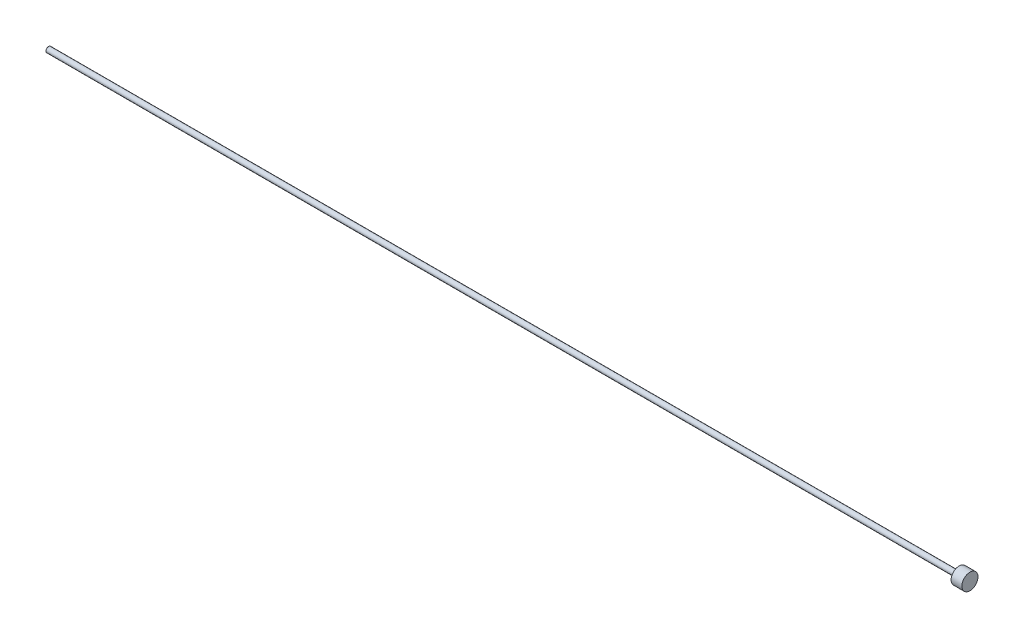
from build123d import *

# Parameters (mm, degrees)
SKETCH2_R               = 3.175
MAIN_BODY_DEPTH         = 1086.2945
SKETCH3_R               = 9.525
PISTON_SIMULATION_DEPTH = 12.7
CHAMFER1_SIZE           = 0.508


with BuildPart() as part:
    # Sketch2 → Main_body (new body)
    with BuildSketch(Plane.ZY.offset(-1390.184351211)):
        Circle(SKETCH2_R)
    extrude(amount=MAIN_BODY_DEPTH)

    # Sketch3 → Piston Simulation (add)
    with BuildSketch(Plane.ZY.offset(-1390.184351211)):
        Circle(SKETCH3_R)
    extrude(amount=PISTON_SIMULATION_DEPTH)

    # Chamfer1
    chamfer1_edges = [part.edges().sort_by_distance(p)[0] for p in [
        (303.889851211, 0, -3.175),
    ]]
    chamfer(chamfer1_edges, length=CHAMFER1_SIZE)


solid = part.part
